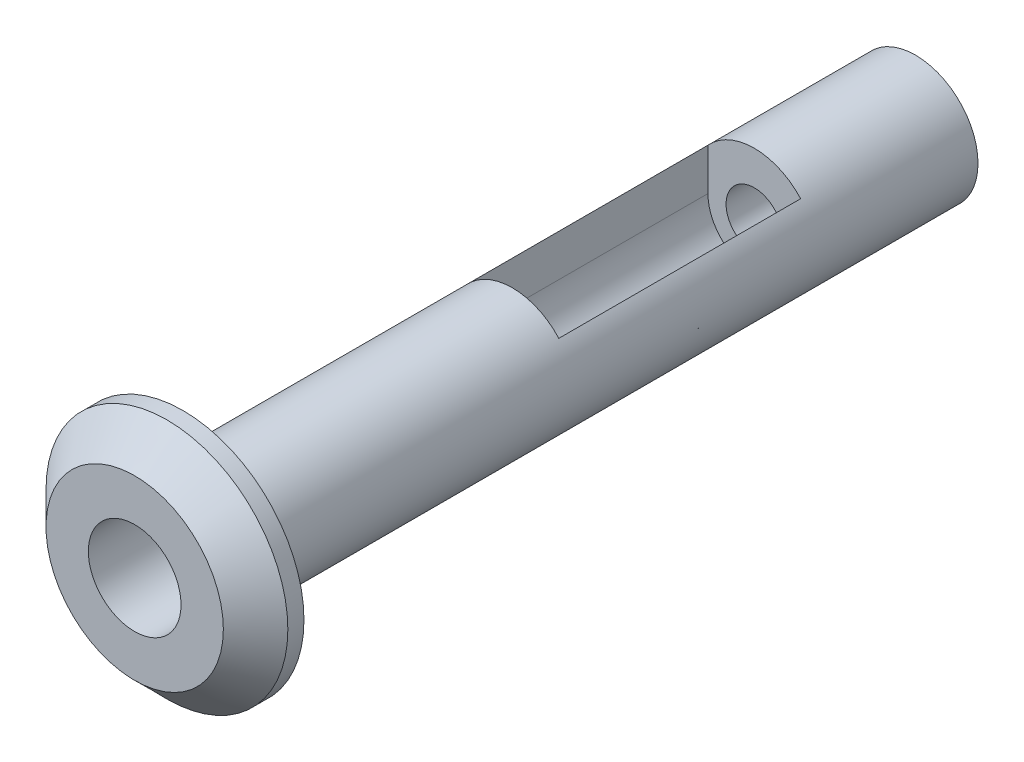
from build123d import *
from build123d.topology import SkipClean

# Parameters (mm, degrees)
CROQUIS1_R              = 7.5
CROQUIS1_R_2            = 1.75
SALIENTE_EXTRUIR1_DEPTH = 1.5
CHAFL_N1_SIZE           = 2
SALIENTE_EXTRUIR2_START = 45.43
CROQUIS2_R              = 3.875
CROQUIS2_R_2            = 1.75
SALIENTE_EXTRUIR2_DEPTH = 45.43
CROQUIS3_R              = 2.875
CORTAR_EXTRUIR1_DEPTH   = 38.43
CORTAR_EXTRUIR2_DEPTH   = 15


with BuildPart() as part:
    # Croquis1 → Saliente-Extruir1 (new, symmetric)
    with BuildSketch(Plane.XY):
        Circle(CROQUIS1_R)
        Circle(CROQUIS1_R_2, mode=Mode.SUBTRACT)
    extrude(amount=SALIENTE_EXTRUIR1_DEPTH, both=True)

    # Chafl_n1
    chafl_n1_edges = [part.edges().sort_by_distance(p)[0] for p in [
        (-7.5, 0, 1.5),
    ]]
    chamfer(chafl_n1_edges, length=CHAFL_N1_SIZE)

    # Croquis2 → Saliente-Extruir2 (add)
    with SkipClean():  # the faces are left unmerged after this step: merging them gives an invalid solid
        with BuildSketch(Plane(origin=(0, 0, -1.5), x_dir=(-1, 0, 0), z_dir=(0, 0, -1)).offset(SALIENTE_EXTRUIR2_START)):
            with Locations(Location((0, 0, 0), (0, 0, 180))):
                Circle(CROQUIS2_R)
            Circle(CROQUIS2_R_2, mode=Mode.SUBTRACT)
        extrude(amount=-SALIENTE_EXTRUIR2_DEPTH)

    # Croquis3 → Cortar-Extruir1 (cut)
    with BuildSketch(Plane.XY.offset(1.5)):
        Circle(CROQUIS3_R)
    extrude(amount=-CORTAR_EXTRUIR1_DEPTH, mode=Mode.SUBTRACT)

    # Croquis4 → Cortar-Extruir2 (cut)
    with BuildSketch(Plane.XY.offset(-36.93)):
        with BuildLine():
            Line((0, 0), (-2.875, 0))
            Line((-2.875, 0), (-2.875, 2.598076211))
            ThreePointArc((-2.875, 2.598076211), (0, 3.875), (2.875, 2.598076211))
            Line((2.875, 2.598076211), (2.875, 0))
            Line((2.875, 0), (0, 0))
        make_face()
    extrude(amount=CORTAR_EXTRUIR2_DEPTH, mode=Mode.SUBTRACT)


solid = part.part
